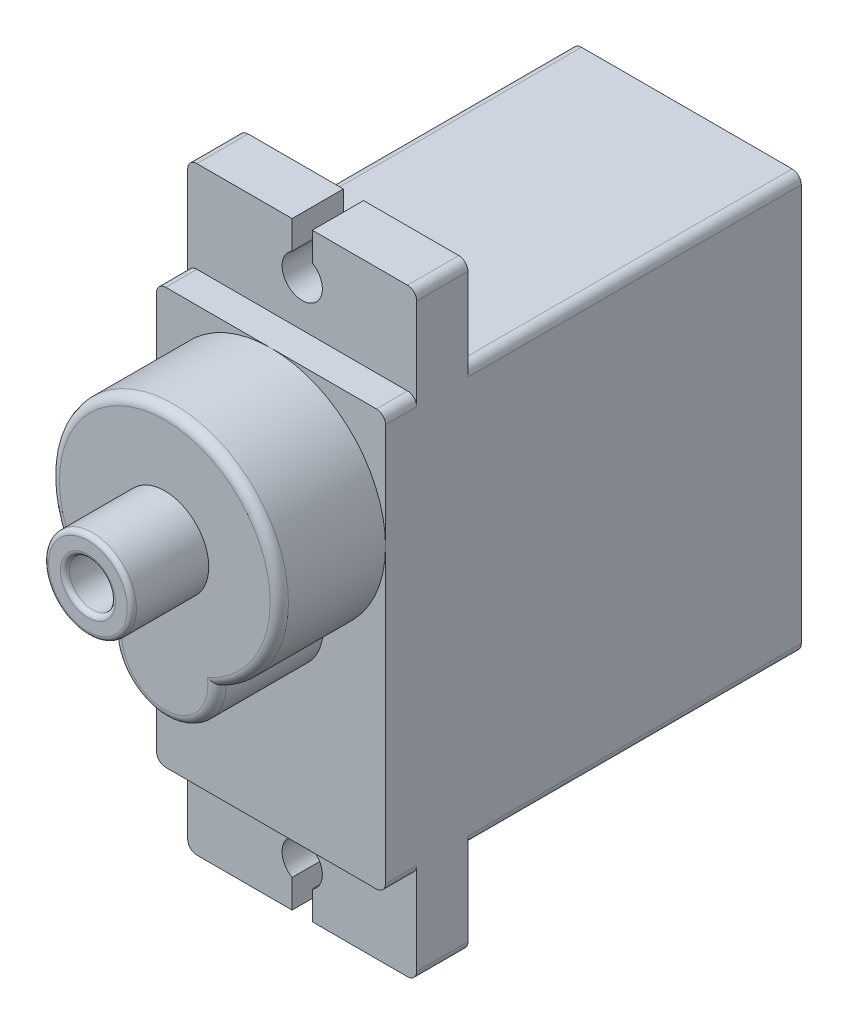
ISO-10303-21;
HEADER;
FILE_DESCRIPTION(('STEP AP214'),'2;1');
FILE_NAME('part.step','',(''),(''),'','','');
FILE_SCHEMA(('AUTOMOTIVE_DESIGN { 1 0 10303 214 1 1 1 1 }'));
ENDSEC;
DATA;
#1=APPLICATION_CONTEXT('core data for automotive mechanical design processes');
#2=APPLICATION_PROTOCOL_DEFINITION('international standard','automotive_design',2000,#1);
#3=PRODUCT_CONTEXT('',#1,'mechanical');
#4=PRODUCT('Part','Part','',(#3));
#5=PRODUCT_RELATED_PRODUCT_CATEGORY('part','',(#4));
#6=PRODUCT_DEFINITION_FORMATION('','',#4);
#7=PRODUCT_DEFINITION_CONTEXT('part definition',#1,'design');
#8=PRODUCT_DEFINITION('design','',#6,#7);
#9=PRODUCT_DEFINITION_SHAPE('','',#8);
#10=(LENGTH_UNIT() NAMED_UNIT(*) SI_UNIT(.MILLI.,.METRE.));
#11=(NAMED_UNIT(*) PLANE_ANGLE_UNIT() SI_UNIT($,.RADIAN.));
#12=(NAMED_UNIT(*) SI_UNIT($,.STERADIAN.) SOLID_ANGLE_UNIT());
#13=UNCERTAINTY_MEASURE_WITH_UNIT(LENGTH_MEASURE(1.E-05),#10,'distance_accuracy_value','');
#14=(GEOMETRIC_REPRESENTATION_CONTEXT(3) GLOBAL_UNCERTAINTY_ASSIGNED_CONTEXT((#13)) GLOBAL_UNIT_ASSIGNED_CONTEXT((#10,
#11,#12)) REPRESENTATION_CONTEXT('',''));
#15=CARTESIAN_POINT('',(0.,0.,0.));
#16=DIRECTION('',(0.,0.,1.));
#17=DIRECTION('',(1.,0.,0.));
#18=AXIS2_PLACEMENT_3D('',#15,#16,#17);
#19=CARTESIAN_POINT('',(-6.25,-16.35,18.2));
#20=DIRECTION('',(0.,-1.,0.));
#21=DIRECTION('',(0.,0.,-1.));
#22=AXIS2_PLACEMENT_3D('',#19,#20,#21);
#23=PLANE('',#22);
#24=DIRECTION('',(0.,0.,1.));
#25=VECTOR('',#24,1.);
#26=CARTESIAN_POINT('',(0.55,-16.35,18.2));
#27=LINE('',#26,#25);
#28=CARTESIAN_POINT('',(0.55,-16.35,18.2));
#29=VERTEX_POINT('',#28);
#30=CARTESIAN_POINT('',(0.55,-16.35,21.));
#31=VERTEX_POINT('',#30);
#32=EDGE_CURVE('E269',#29,#31,#27,.T.);
#33=ORIENTED_EDGE('',*,*,#32,.F.);
#34=DIRECTION('',(1.,0.,0.));
#35=VECTOR('',#34,1.);
#36=CARTESIAN_POINT('',(-6.25,-16.35,18.2));
#37=LINE('',#36,#35);
#38=CARTESIAN_POINT('',(5.75,-16.35,18.2));
#39=VERTEX_POINT('',#38);
#40=EDGE_CURVE('E568',#29,#39,#37,.T.);
#41=ORIENTED_EDGE('',*,*,#40,.T.);
#42=DIRECTION('',(0.,0.,1.));
#43=VECTOR('',#42,1.);
#44=CARTESIAN_POINT('',(5.75,-16.35,21.));
#45=LINE('',#44,#43);
#46=CARTESIAN_POINT('',(5.75,-16.35,21.));
#47=VERTEX_POINT('',#46);
#48=EDGE_CURVE('E290',#39,#47,#45,.T.);
#49=ORIENTED_EDGE('',*,*,#48,.T.);
#50=DIRECTION('',(1.,0.,0.));
#51=VECTOR('',#50,1.);
#52=CARTESIAN_POINT('',(-6.25,-16.35,21.));
#53=LINE('',#52,#51);
#54=EDGE_CURVE('E281',#31,#47,#53,.T.);
#55=ORIENTED_EDGE('',*,*,#54,.F.);
#56=EDGE_LOOP('',(#33,#41,#49,#55));
#57=FACE_BOUND('',#56,.T.);
#58=ADVANCED_FACE('F36',(#57),#23,.T.);
#59=CARTESIAN_POINT('',(-6.25,16.35,18.2));
#60=DIRECTION('',(0.,1.,0.));
#61=DIRECTION('',(0.,0.,1.));
#62=AXIS2_PLACEMENT_3D('',#59,#60,#61);
#63=PLANE('',#62);
#64=DIRECTION('',(0.,0.,-1.));
#65=VECTOR('',#64,1.);
#66=CARTESIAN_POINT('',(0.55,16.35,18.2));
#67=LINE('',#66,#65);
#68=CARTESIAN_POINT('',(0.55,16.35,21.));
#69=VERTEX_POINT('',#68);
#70=CARTESIAN_POINT('',(0.55,16.35,18.2));
#71=VERTEX_POINT('',#70);
#72=EDGE_CURVE('E608',#69,#71,#67,.T.);
#73=ORIENTED_EDGE('',*,*,#72,.F.);
#74=DIRECTION('',(-1.,0.,0.));
#75=VECTOR('',#74,1.);
#76=CARTESIAN_POINT('',(-6.25,16.35,21.));
#77=LINE('',#76,#75);
#78=CARTESIAN_POINT('',(5.75,16.35,21.));
#79=VERTEX_POINT('',#78);
#80=EDGE_CURVE('E306',#79,#69,#77,.T.);
#81=ORIENTED_EDGE('',*,*,#80,.F.);
#82=DIRECTION('',(0.,0.,1.));
#83=VECTOR('',#82,1.);
#84=CARTESIAN_POINT('',(5.75,16.35,18.2));
#85=LINE('',#84,#83);
#86=CARTESIAN_POINT('',(5.75,16.35,18.2));
#87=VERTEX_POINT('',#86);
#88=EDGE_CURVE('E434',#79,#87,#85,.F.);
#89=ORIENTED_EDGE('',*,*,#88,.T.);
#90=DIRECTION('',(-1.,0.,0.));
#91=VECTOR('',#90,1.);
#92=CARTESIAN_POINT('',(-6.25,16.35,18.2));
#93=LINE('',#92,#91);
#94=EDGE_CURVE('E313',#87,#71,#93,.T.);
#95=ORIENTED_EDGE('',*,*,#94,.T.);
#96=EDGE_LOOP('',(#73,#81,#89,#95));
#97=FACE_BOUND('',#96,.T.);
#98=ADVANCED_FACE('F525',(#97),#63,.T.);
#99=CARTESIAN_POINT('',(0.,0.,22.7));
#100=DIRECTION('',(0.,0.,1.));
#101=DIRECTION('',(1.,0.,0.));
#102=AXIS2_PLACEMENT_3D('',#99,#100,#101);
#103=PLANE('',#102);
#104=CARTESIAN_POINT('',(0.,5.09999999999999,22.7));
#105=DIRECTION('',(0.,0.,1.));
#106=DIRECTION('',(1.,0.,0.));
#107=AXIS2_PLACEMENT_3D('',#104,#105,#106);
#108=CIRCLE('',#107,6.25);
#109=CARTESIAN_POINT('',(6.25,5.09999999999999,22.7));
#110=VERTEX_POINT('',#109);
#111=CARTESIAN_POINT('',(0.,11.35,22.7));
#112=VERTEX_POINT('',#111);
#113=EDGE_CURVE('E589',#110,#112,#108,.T.);
#114=ORIENTED_EDGE('',*,*,#113,.F.);
#115=DIRECTION('',(0.,1.,0.));
#116=VECTOR('',#115,1.);
#117=CARTESIAN_POINT('',(6.25,11.35,22.7));
#118=LINE('',#117,#116);
#119=CARTESIAN_POINT('',(6.25,10.85,22.7));
#120=VERTEX_POINT('',#119);
#121=EDGE_CURVE('E333',#110,#120,#118,.T.);
#122=ORIENTED_EDGE('',*,*,#121,.T.);
#123=CARTESIAN_POINT('',(5.75,10.85,22.7));
#124=DIRECTION('',(0.,0.,1.));
#125=DIRECTION('',(1.,0.,0.));
#126=AXIS2_PLACEMENT_3D('',#123,#124,#125);
#127=CIRCLE('',#126,0.5);
#128=CARTESIAN_POINT('',(5.75,11.35,22.7));
#129=VERTEX_POINT('',#128);
#130=EDGE_CURVE('E402',#120,#129,#127,.T.);
#131=ORIENTED_EDGE('',*,*,#130,.T.);
#132=DIRECTION('',(-1.,0.,0.));
#133=VECTOR('',#132,1.);
#134=CARTESIAN_POINT('',(-6.25,11.35,22.7));
#135=LINE('',#134,#133);
#136=EDGE_CURVE('E334',#129,#112,#135,.T.);
#137=ORIENTED_EDGE('',*,*,#136,.T.);
#138=EDGE_LOOP('',(#114,#122,#131,#137));
#139=FACE_BOUND('',#138,.T.);
#140=ADVANCED_FACE('F531',(#139),#103,.T.);
#141=CARTESIAN_POINT('',(-6.25,5.09999999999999,22.7));
#142=VERTEX_POINT('',#141);
#143=EDGE_CURVE('E476',#112,#142,#108,.T.);
#144=ORIENTED_EDGE('',*,*,#143,.F.);
#145=CARTESIAN_POINT('',(-5.75,11.35,22.7));
#146=VERTEX_POINT('',#145);
#147=EDGE_CURVE('E332',#112,#146,#135,.T.);
#148=ORIENTED_EDGE('',*,*,#147,.T.);
#149=CARTESIAN_POINT('',(-5.75,10.85,22.7));
#150=DIRECTION('',(0.,0.,1.));
#151=DIRECTION('',(1.,0.,0.));
#152=AXIS2_PLACEMENT_3D('',#149,#150,#151);
#153=CIRCLE('',#152,0.5);
#154=CARTESIAN_POINT('',(-6.25,10.85,22.7));
#155=VERTEX_POINT('',#154);
#156=EDGE_CURVE('E404',#146,#155,#153,.T.);
#157=ORIENTED_EDGE('',*,*,#156,.T.);
#158=DIRECTION('',(0.,-1.,0.));
#159=VECTOR('',#158,1.);
#160=CARTESIAN_POINT('',(-6.25,11.35,22.7));
#161=LINE('',#160,#159);
#162=EDGE_CURVE('E338',#155,#142,#161,.T.);
#163=ORIENTED_EDGE('',*,*,#162,.T.);
#164=EDGE_LOOP('',(#144,#148,#157,#163));
#165=FACE_BOUND('',#164,.T.);
#166=ADVANCED_FACE('F914',(#165),#103,.T.);
#167=CARTESIAN_POINT('',(-6.25,-11.35,22.7));
#168=DIRECTION('',(0.,1.,0.));
#169=DIRECTION('',(0.,0.,1.));
#170=AXIS2_PLACEMENT_3D('',#167,#168,#169);
#171=PLANE('',#170);
#172=DIRECTION('',(1.,0.,0.));
#173=VECTOR('',#172,1.);
#174=CARTESIAN_POINT('',(-6.25,-11.35,22.7));
#175=LINE('',#174,#173);
#176=CARTESIAN_POINT('',(-5.75,-11.35,22.7));
#177=VERTEX_POINT('',#176);
#178=CARTESIAN_POINT('',(5.75,-11.35,22.7));
#179=VERTEX_POINT('',#178);
#180=EDGE_CURVE('E341',#177,#179,#175,.T.);
#181=ORIENTED_EDGE('',*,*,#180,.F.);
#182=DIRECTION('',(0.,0.,-1.));
#183=VECTOR('',#182,1.);
#184=CARTESIAN_POINT('',(-5.75,-11.35,22.7));
#185=LINE('',#184,#183);
#186=CARTESIAN_POINT('',(-5.75,-11.35,21.));
#187=VERTEX_POINT('',#186);
#188=EDGE_CURVE('E399',#177,#187,#185,.T.);
#189=ORIENTED_EDGE('',*,*,#188,.T.);
#190=DIRECTION('',(-1.,0.,0.));
#191=VECTOR('',#190,1.);
#192=CARTESIAN_POINT('',(-6.25,-11.35,21.));
#193=LINE('',#192,#191);
#194=CARTESIAN_POINT('',(5.75,-11.35,21.));
#195=VERTEX_POINT('',#194);
#196=EDGE_CURVE('E297',#195,#187,#193,.T.);
#197=ORIENTED_EDGE('',*,*,#196,.F.);
#198=DIRECTION('',(0.,0.,-1.));
#199=VECTOR('',#198,1.);
#200=CARTESIAN_POINT('',(5.75,-11.35,22.7));
#201=LINE('',#200,#199);
#202=EDGE_CURVE('E397',#195,#179,#201,.F.);
#203=ORIENTED_EDGE('',*,*,#202,.T.);
#204=EDGE_LOOP('',(#181,#189,#197,#203));
#205=FACE_BOUND('',#204,.T.);
#206=ADVANCED_FACE('F920',(#205),#171,.F.);
#207=CARTESIAN_POINT('',(-6.25,11.35,22.7));
#208=DIRECTION('',(0.,-1.,0.));
#209=DIRECTION('',(0.,0.,-1.));
#210=AXIS2_PLACEMENT_3D('',#207,#208,#209);
#211=PLANE('',#210);
#212=DIRECTION('',(1.,0.,0.));
#213=VECTOR('',#212,1.);
#214=CARTESIAN_POINT('',(-6.25,11.35,21.));
#215=LINE('',#214,#213);
#216=CARTESIAN_POINT('',(-5.75,11.35,21.));
#217=VERTEX_POINT('',#216);
#218=CARTESIAN_POINT('',(5.75,11.35,21.));
#219=VERTEX_POINT('',#218);
#220=EDGE_CURVE('E319',#217,#219,#215,.T.);
#221=ORIENTED_EDGE('',*,*,#220,.F.);
#222=DIRECTION('',(0.,0.,-1.));
#223=VECTOR('',#222,1.);
#224=CARTESIAN_POINT('',(-5.75,11.35,22.7));
#225=LINE('',#224,#223);
#226=EDGE_CURVE('E449',#217,#146,#225,.F.);
#227=ORIENTED_EDGE('',*,*,#226,.T.);
#228=ORIENTED_EDGE('',*,*,#147,.F.);
#229=ORIENTED_EDGE('',*,*,#136,.F.);
#230=DIRECTION('',(0.,0.,-1.));
#231=VECTOR('',#230,1.);
#232=CARTESIAN_POINT('',(5.75,11.35,22.7));
#233=LINE('',#232,#231);
#234=EDGE_CURVE('E446',#129,#219,#233,.T.);
#235=ORIENTED_EDGE('',*,*,#234,.T.);
#236=EDGE_LOOP('',(#221,#227,#228,#229,#235));
#237=FACE_BOUND('',#236,.T.);
#238=ADVANCED_FACE('F951',(#237),#211,.F.);
#239=CARTESIAN_POINT('',(6.25,11.35,22.7));
#240=DIRECTION('',(-1.,0.,0.));
#241=DIRECTION('',(0.,-1.,0.));
#242=AXIS2_PLACEMENT_3D('',#239,#240,#241);
#243=PLANE('',#242);
#244=CARTESIAN_POINT('',(6.25,-10.85,22.7));
#245=VERTEX_POINT('',#244);
#246=EDGE_CURVE('E329',#245,#110,#118,.T.);
#247=ORIENTED_EDGE('',*,*,#246,.F.);
#248=DIRECTION('',(0.,0.,-1.));
#249=VECTOR('',#248,1.);
#250=CARTESIAN_POINT('',(6.25,-10.85,22.7));
#251=LINE('',#250,#249);
#252=CARTESIAN_POINT('',(6.25,-10.85,21.));
#253=VERTEX_POINT('',#252);
#254=EDGE_CURVE('E424',#245,#253,#251,.T.);
#255=ORIENTED_EDGE('',*,*,#254,.T.);
#256=DIRECTION('',(0.,1.,0.));
#257=VECTOR('',#256,1.);
#258=CARTESIAN_POINT('',(6.25,-11.35,21.));
#259=LINE('',#258,#257);
#260=CARTESIAN_POINT('',(6.25,-15.85,21.));
#261=VERTEX_POINT('',#260);
#262=EDGE_CURVE('E295',#261,#253,#259,.T.);
#263=ORIENTED_EDGE('',*,*,#262,.F.);
#264=DIRECTION('',(0.,0.,1.));
#265=VECTOR('',#264,1.);
#266=CARTESIAN_POINT('',(6.25,-15.85,18.2));
#267=LINE('',#266,#265);
#268=CARTESIAN_POINT('',(6.25,-15.85,18.2));
#269=VERTEX_POINT('',#268);
#270=EDGE_CURVE('E422',#261,#269,#267,.F.);
#271=ORIENTED_EDGE('',*,*,#270,.T.);
#272=DIRECTION('',(0.,1.,0.));
#273=VECTOR('',#272,1.);
#274=CARTESIAN_POINT('',(6.25,-11.35,18.2));
#275=LINE('',#274,#273);
#276=CARTESIAN_POINT('',(6.25,-10.85,18.2));
#277=VERTEX_POINT('',#276);
#278=EDGE_CURVE('E320',#269,#277,#275,.T.);
#279=ORIENTED_EDGE('',*,*,#278,.T.);
#280=DIRECTION('',(0.,0.,-1.));
#281=VECTOR('',#280,1.);
#282=CARTESIAN_POINT('',(6.25,-10.85,22.7));
#283=LINE('',#282,#281);
#284=CARTESIAN_POINT('',(6.25,-10.85,0.));
#285=VERTEX_POINT('',#284);
#286=EDGE_CURVE('E419',#277,#285,#283,.T.);
#287=ORIENTED_EDGE('',*,*,#286,.T.);
#288=DIRECTION('',(0.,1.,0.));
#289=VECTOR('',#288,1.);
#290=CARTESIAN_POINT('',(6.25,11.35,0.));
#291=LINE('',#290,#289);
#292=CARTESIAN_POINT('',(6.25,10.85,0.));
#293=VERTEX_POINT('',#292);
#294=EDGE_CURVE('E316',#285,#293,#291,.T.);
#295=ORIENTED_EDGE('',*,*,#294,.T.);
#296=DIRECTION('',(0.,0.,-1.));
#297=VECTOR('',#296,1.);
#298=CARTESIAN_POINT('',(6.25,10.85,22.7));
#299=LINE('',#298,#297);
#300=CARTESIAN_POINT('',(6.25,10.85,18.2));
#301=VERTEX_POINT('',#300);
#302=EDGE_CURVE('E410',#293,#301,#299,.F.);
#303=ORIENTED_EDGE('',*,*,#302,.T.);
#304=DIRECTION('',(0.,1.,0.));
#305=VECTOR('',#304,1.);
#306=CARTESIAN_POINT('',(6.25,11.35,18.2));
#307=LINE('',#306,#305);
#308=CARTESIAN_POINT('',(6.25,15.85,18.2));
#309=VERTEX_POINT('',#308);
#310=EDGE_CURVE('E309',#301,#309,#307,.T.);
#311=ORIENTED_EDGE('',*,*,#310,.T.);
#312=DIRECTION('',(0.,0.,1.));
#313=VECTOR('',#312,1.);
#314=CARTESIAN_POINT('',(6.25,15.85,21.));
#315=LINE('',#314,#313);
#316=CARTESIAN_POINT('',(6.25,15.85,21.));
#317=VERTEX_POINT('',#316);
#318=EDGE_CURVE('E416',#309,#317,#315,.T.);
#319=ORIENTED_EDGE('',*,*,#318,.T.);
#320=DIRECTION('',(0.,1.,0.));
#321=VECTOR('',#320,1.);
#322=CARTESIAN_POINT('',(6.25,11.35,21.));
#323=LINE('',#322,#321);
#324=CARTESIAN_POINT('',(6.25,10.85,21.));
#325=VERTEX_POINT('',#324);
#326=EDGE_CURVE('E323',#325,#317,#323,.T.);
#327=ORIENTED_EDGE('',*,*,#326,.F.);
#328=DIRECTION('',(0.,0.,-1.));
#329=VECTOR('',#328,1.);
#330=CARTESIAN_POINT('',(6.25,10.85,22.7));
#331=LINE('',#330,#329);
#332=EDGE_CURVE('E413',#325,#120,#331,.F.);
#333=ORIENTED_EDGE('',*,*,#332,.T.);
#334=ORIENTED_EDGE('',*,*,#121,.F.);
#335=EDGE_LOOP('',(#247,#255,#263,#271,#279,#287,#295,#303,#311,#319,#327,#333,#334));
#336=FACE_BOUND('',#335,.T.);
#337=ADVANCED_FACE('F960',(#336),#243,.F.);
#338=DIRECTION('',(-1.,0.,0.));
#339=VECTOR('',#338,1.);
#340=CARTESIAN_POINT('',(-6.25,11.35,0.));
#341=LINE('',#340,#339);
#342=CARTESIAN_POINT('',(5.75,11.35,0.));
#343=VERTEX_POINT('',#342);
#344=CARTESIAN_POINT('',(-5.75,11.35,0.));
#345=VERTEX_POINT('',#344);
#346=EDGE_CURVE('E347',#343,#345,#341,.T.);
#347=ORIENTED_EDGE('',*,*,#346,.T.);
#348=DIRECTION('',(0.,0.,-1.));
#349=VECTOR('',#348,1.);
#350=CARTESIAN_POINT('',(-5.75,11.35,22.7));
#351=LINE('',#350,#349);
#352=CARTESIAN_POINT('',(-5.75,11.35,18.2));
#353=VERTEX_POINT('',#352);
#354=EDGE_CURVE('E444',#345,#353,#351,.F.);
#355=ORIENTED_EDGE('',*,*,#354,.T.);
#356=DIRECTION('',(1.,0.,0.));
#357=VECTOR('',#356,1.);
#358=CARTESIAN_POINT('',(-6.25,11.35,18.2));
#359=LINE('',#358,#357);
#360=CARTESIAN_POINT('',(5.75,11.35,18.2));
#361=VERTEX_POINT('',#360);
#362=EDGE_CURVE('E305',#353,#361,#359,.T.);
#363=ORIENTED_EDGE('',*,*,#362,.T.);
#364=DIRECTION('',(0.,0.,-1.));
#365=VECTOR('',#364,1.);
#366=CARTESIAN_POINT('',(5.75,11.35,22.7));
#367=LINE('',#366,#365);
#368=EDGE_CURVE('E441',#361,#343,#367,.T.);
#369=ORIENTED_EDGE('',*,*,#368,.T.);
#370=EDGE_LOOP('',(#347,#355,#363,#369));
#371=FACE_BOUND('',#370,.T.);
#372=ADVANCED_FACE('F963',(#371),#211,.F.);
#373=CARTESIAN_POINT('',(-6.25,11.35,22.7));
#374=DIRECTION('',(1.,0.,0.));
#375=DIRECTION('',(0.,1.,0.));
#376=AXIS2_PLACEMENT_3D('',#373,#374,#375);
#377=PLANE('',#376);
#378=DIRECTION('',(0.,-1.,0.));
#379=VECTOR('',#378,1.);
#380=CARTESIAN_POINT('',(-6.25,11.35,0.));
#381=LINE('',#380,#379);
#382=CARTESIAN_POINT('',(-6.25,10.85,0.));
#383=VERTEX_POINT('',#382);
#384=CARTESIAN_POINT('',(-6.25,-10.85,0.));
#385=VERTEX_POINT('',#384);
#386=EDGE_CURVE('E350',#383,#385,#381,.T.);
#387=ORIENTED_EDGE('',*,*,#386,.T.);
#388=DIRECTION('',(0.,0.,-1.));
#389=VECTOR('',#388,1.);
#390=CARTESIAN_POINT('',(-6.25,-10.85,22.7));
#391=LINE('',#390,#389);
#392=CARTESIAN_POINT('',(-6.25,-10.85,18.2));
#393=VERTEX_POINT('',#392);
#394=EDGE_CURVE('E382',#385,#393,#391,.F.);
#395=ORIENTED_EDGE('',*,*,#394,.T.);
#396=DIRECTION('',(0.,-1.,0.));
#397=VECTOR('',#396,1.);
#398=CARTESIAN_POINT('',(-6.25,-11.35,18.2));
#399=LINE('',#398,#397);
#400=CARTESIAN_POINT('',(-6.25,-15.85,18.2));
#401=VERTEX_POINT('',#400);
#402=EDGE_CURVE('E565',#393,#401,#399,.T.);
#403=ORIENTED_EDGE('',*,*,#402,.T.);
#404=DIRECTION('',(0.,0.,1.));
#405=VECTOR('',#404,1.);
#406=CARTESIAN_POINT('',(-6.25,-15.85,21.));
#407=LINE('',#406,#405);
#408=CARTESIAN_POINT('',(-6.25,-15.85,21.));
#409=VERTEX_POINT('',#408);
#410=EDGE_CURVE('E379',#401,#409,#407,.T.);
#411=ORIENTED_EDGE('',*,*,#410,.T.);
#412=DIRECTION('',(0.,-1.,0.));
#413=VECTOR('',#412,1.);
#414=CARTESIAN_POINT('',(-6.25,-11.35,21.));
#415=LINE('',#414,#413);
#416=CARTESIAN_POINT('',(-6.25,-10.85,21.));
#417=VERTEX_POINT('',#416);
#418=EDGE_CURVE('E292',#417,#409,#415,.T.);
#419=ORIENTED_EDGE('',*,*,#418,.F.);
#420=DIRECTION('',(0.,0.,-1.));
#421=VECTOR('',#420,1.);
#422=CARTESIAN_POINT('',(-6.25,-10.85,22.7));
#423=LINE('',#422,#421);
#424=CARTESIAN_POINT('',(-6.25,-10.85,22.7));
#425=VERTEX_POINT('',#424);
#426=EDGE_CURVE('E376',#417,#425,#423,.F.);
#427=ORIENTED_EDGE('',*,*,#426,.T.);
#428=EDGE_CURVE('E337',#142,#425,#161,.T.);
#429=ORIENTED_EDGE('',*,*,#428,.F.);
#430=ORIENTED_EDGE('',*,*,#162,.F.);
#431=DIRECTION('',(0.,0.,-1.));
#432=VECTOR('',#431,1.);
#433=CARTESIAN_POINT('',(-6.25,10.85,22.7));
#434=LINE('',#433,#432);
#435=CARTESIAN_POINT('',(-6.25,10.85,21.));
#436=VERTEX_POINT('',#435);
#437=EDGE_CURVE('E368',#155,#436,#434,.T.);
#438=ORIENTED_EDGE('',*,*,#437,.T.);
#439=DIRECTION('',(0.,-1.,0.));
#440=VECTOR('',#439,1.);
#441=CARTESIAN_POINT('',(-6.25,11.35,21.));
#442=LINE('',#441,#440);
#443=CARTESIAN_POINT('',(-6.25,15.85,21.));
#444=VERTEX_POINT('',#443);
#445=EDGE_CURVE('E317',#444,#436,#442,.T.);
#446=ORIENTED_EDGE('',*,*,#445,.F.);
#447=DIRECTION('',(0.,0.,1.));
#448=VECTOR('',#447,1.);
#449=CARTESIAN_POINT('',(-6.25,15.85,18.2));
#450=LINE('',#449,#448);
#451=CARTESIAN_POINT('',(-6.25,15.85,18.2));
#452=VERTEX_POINT('',#451);
#453=EDGE_CURVE('E374',#444,#452,#450,.F.);
#454=ORIENTED_EDGE('',*,*,#453,.T.);
#455=DIRECTION('',(0.,-1.,0.));
#456=VECTOR('',#455,1.);
#457=CARTESIAN_POINT('',(-6.25,11.35,18.2));
#458=LINE('',#457,#456);
#459=CARTESIAN_POINT('',(-6.25,10.85,18.2));
#460=VERTEX_POINT('',#459);
#461=EDGE_CURVE('E303',#452,#460,#458,.T.);
#462=ORIENTED_EDGE('',*,*,#461,.T.);
#463=DIRECTION('',(0.,0.,-1.));
#464=VECTOR('',#463,1.);
#465=CARTESIAN_POINT('',(-6.25,10.85,22.7));
#466=LINE('',#465,#464);
#467=EDGE_CURVE('E371',#460,#383,#466,.T.);
#468=ORIENTED_EDGE('',*,*,#467,.T.);
#469=EDGE_LOOP('',(#387,#395,#403,#411,#419,#427,#429,#430,#438,#446,#454,#462,#468));
#470=FACE_BOUND('',#469,.T.);
#471=ADVANCED_FACE('F564',(#470),#377,.F.);
#472=DIRECTION('',(-1.,0.,0.));
#473=VECTOR('',#472,1.);
#474=CARTESIAN_POINT('',(-6.25,-11.35,18.2));
#475=LINE('',#474,#473);
#476=CARTESIAN_POINT('',(5.75,-11.35,18.2));
#477=VERTEX_POINT('',#476);
#478=CARTESIAN_POINT('',(-5.75,-11.35,18.2));
#479=VERTEX_POINT('',#478);
#480=EDGE_CURVE('E302',#477,#479,#475,.T.);
#481=ORIENTED_EDGE('',*,*,#480,.T.);
#482=DIRECTION('',(0.,0.,-1.));
#483=VECTOR('',#482,1.);
#484=CARTESIAN_POINT('',(-5.75,-11.35,22.7));
#485=LINE('',#484,#483);
#486=CARTESIAN_POINT('',(-5.75,-11.35,0.));
#487=VERTEX_POINT('',#486);
#488=EDGE_CURVE('E357',#479,#487,#485,.T.);
#489=ORIENTED_EDGE('',*,*,#488,.T.);
#490=DIRECTION('',(1.,0.,0.));
#491=VECTOR('',#490,1.);
#492=CARTESIAN_POINT('',(-6.25,-11.35,0.));
#493=LINE('',#492,#491);
#494=CARTESIAN_POINT('',(5.75,-11.35,0.));
#495=VERTEX_POINT('',#494);
#496=EDGE_CURVE('E353',#487,#495,#493,.T.);
#497=ORIENTED_EDGE('',*,*,#496,.T.);
#498=DIRECTION('',(0.,0.,-1.));
#499=VECTOR('',#498,1.);
#500=CARTESIAN_POINT('',(5.75,-11.35,22.7));
#501=LINE('',#500,#499);
#502=EDGE_CURVE('E344',#495,#477,#501,.F.);
#503=ORIENTED_EDGE('',*,*,#502,.T.);
#504=EDGE_LOOP('',(#481,#489,#497,#503));
#505=FACE_BOUND('',#504,.T.);
#506=ADVANCED_FACE('F954',(#505),#171,.F.);
#507=CARTESIAN_POINT('',(0.,-0.500000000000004,22.7));
#508=DIRECTION('',(0.,0.,1.));
#509=DIRECTION('',(1.,0.,0.));
#510=AXIS2_PLACEMENT_3D('',#507,#508,#509);
#511=CIRCLE('',#510,2.85);
#512=CARTESIAN_POINT('',(-2.8497532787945,-0.46250000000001,22.7));
#513=VERTEX_POINT('',#512);
#514=CARTESIAN_POINT('',(2.8497532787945,-0.46250000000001,22.7));
#515=VERTEX_POINT('',#514);
#516=EDGE_CURVE('E600',#513,#515,#511,.T.);
#517=ORIENTED_EDGE('',*,*,#516,.F.);
#518=EDGE_CURVE('E595',#142,#513,#108,.T.);
#519=ORIENTED_EDGE('',*,*,#518,.F.);
#520=ORIENTED_EDGE('',*,*,#428,.T.);
#521=CARTESIAN_POINT('',(-5.75,-10.85,22.7));
#522=DIRECTION('',(0.,0.,1.));
#523=DIRECTION('',(1.,0.,0.));
#524=AXIS2_PLACEMENT_3D('',#521,#522,#523);
#525=CIRCLE('',#524,0.5);
#526=EDGE_CURVE('E408',#425,#177,#525,.T.);
#527=ORIENTED_EDGE('',*,*,#526,.T.);
#528=ORIENTED_EDGE('',*,*,#180,.T.);
#529=CARTESIAN_POINT('',(5.75,-10.85,22.7));
#530=DIRECTION('',(0.,0.,1.));
#531=DIRECTION('',(1.,0.,0.));
#532=AXIS2_PLACEMENT_3D('',#529,#530,#531);
#533=CIRCLE('',#532,0.5);
#534=EDGE_CURVE('E406',#179,#245,#533,.T.);
#535=ORIENTED_EDGE('',*,*,#534,.T.);
#536=ORIENTED_EDGE('',*,*,#246,.T.);
#537=EDGE_CURVE('E472',#515,#110,#108,.T.);
#538=ORIENTED_EDGE('',*,*,#537,.F.);
#539=EDGE_LOOP('',(#517,#519,#520,#527,#528,#535,#536,#538));
#540=FACE_BOUND('',#539,.T.);
#541=ADVANCED_FACE('F923',(#540),#103,.T.);
#542=CARTESIAN_POINT('',(0.,0.,0.));
#543=DIRECTION('',(0.,0.,1.));
#544=DIRECTION('',(1.,0.,0.));
#545=AXIS2_PLACEMENT_3D('',#542,#543,#544);
#546=PLANE('',#545);
#547=ORIENTED_EDGE('',*,*,#496,.F.);
#548=CARTESIAN_POINT('',(-5.75,-10.85,0.));
#549=DIRECTION('',(0.,0.,1.));
#550=DIRECTION('',(1.,0.,0.));
#551=AXIS2_PLACEMENT_3D('',#548,#549,#550);
#552=CIRCLE('',#551,0.5);
#553=EDGE_CURVE('E366',#487,#385,#552,.F.);
#554=ORIENTED_EDGE('',*,*,#553,.T.);
#555=ORIENTED_EDGE('',*,*,#386,.F.);
#556=CARTESIAN_POINT('',(-5.75,10.85,0.));
#557=DIRECTION('',(0.,0.,1.));
#558=DIRECTION('',(1.,0.,0.));
#559=AXIS2_PLACEMENT_3D('',#556,#557,#558);
#560=CIRCLE('',#559,0.5);
#561=EDGE_CURVE('E362',#383,#345,#560,.F.);
#562=ORIENTED_EDGE('',*,*,#561,.T.);
#563=ORIENTED_EDGE('',*,*,#346,.F.);
#564=CARTESIAN_POINT('',(5.75,10.85,0.));
#565=DIRECTION('',(0.,0.,1.));
#566=DIRECTION('',(1.,0.,0.));
#567=AXIS2_PLACEMENT_3D('',#564,#565,#566);
#568=CIRCLE('',#567,0.5);
#569=EDGE_CURVE('E360',#343,#293,#568,.F.);
#570=ORIENTED_EDGE('',*,*,#569,.T.);
#571=ORIENTED_EDGE('',*,*,#294,.F.);
#572=CARTESIAN_POINT('',(5.75,-10.85,0.));
#573=DIRECTION('',(0.,0.,1.));
#574=DIRECTION('',(1.,0.,0.));
#575=AXIS2_PLACEMENT_3D('',#572,#573,#574);
#576=CIRCLE('',#575,0.5);
#577=EDGE_CURVE('E364',#285,#495,#576,.F.);
#578=ORIENTED_EDGE('',*,*,#577,.T.);
#579=EDGE_LOOP('',(#547,#554,#555,#562,#563,#570,#571,#578));
#580=FACE_BOUND('',#579,.T.);
#581=ADVANCED_FACE('F856',(#580),#546,.F.);
#582=DIRECTION('',(0.,0.,1.));
#583=VECTOR('',#582,1.);
#584=CARTESIAN_POINT('',(-0.55,16.35,18.2));
#585=LINE('',#584,#583);
#586=CARTESIAN_POINT('',(-0.55,16.35,18.2));
#587=VERTEX_POINT('',#586);
#588=CARTESIAN_POINT('',(-0.55,16.35,21.));
#589=VERTEX_POINT('',#588);
#590=EDGE_CURVE('E612',#587,#589,#585,.T.);
#591=ORIENTED_EDGE('',*,*,#590,.F.);
#592=CARTESIAN_POINT('',(-5.75,16.35,18.2));
#593=VERTEX_POINT('',#592);
#594=EDGE_CURVE('E312',#587,#593,#93,.T.);
#595=ORIENTED_EDGE('',*,*,#594,.T.);
#596=DIRECTION('',(0.,0.,1.));
#597=VECTOR('',#596,1.);
#598=CARTESIAN_POINT('',(-5.75,16.35,21.));
#599=LINE('',#598,#597);
#600=CARTESIAN_POINT('',(-5.75,16.35,21.));
#601=VERTEX_POINT('',#600);
#602=EDGE_CURVE('E431',#593,#601,#599,.T.);
#603=ORIENTED_EDGE('',*,*,#602,.T.);
#604=EDGE_CURVE('E326',#589,#601,#77,.T.);
#605=ORIENTED_EDGE('',*,*,#604,.F.);
#606=EDGE_LOOP('',(#591,#595,#603,#605));
#607=FACE_BOUND('',#606,.T.);
#608=ADVANCED_FACE('F534',(#607),#63,.T.);
#609=CARTESIAN_POINT('',(0.,0.,18.2));
#610=DIRECTION('',(0.,0.,-1.));
#611=DIRECTION('',(-1.,0.,0.));
#612=AXIS2_PLACEMENT_3D('',#609,#610,#611);
#613=PLANE('',#612);
#614=DIRECTION('',(0.,-1.,0.));
#615=VECTOR('',#614,1.);
#616=CARTESIAN_POINT('',(0.55,0.,18.2));
#617=LINE('',#616,#615);
#618=CARTESIAN_POINT('',(0.55,14.8026279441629,18.2));
#619=VERTEX_POINT('',#618);
#620=EDGE_CURVE('E610',#71,#619,#617,.T.);
#621=ORIENTED_EDGE('',*,*,#620,.F.);
#622=ORIENTED_EDGE('',*,*,#94,.F.);
#623=CARTESIAN_POINT('',(5.75,15.85,18.2));
#624=DIRECTION('',(0.,0.,-1.));
#625=DIRECTION('',(-1.,0.,0.));
#626=AXIS2_PLACEMENT_3D('',#623,#624,#625);
#627=CIRCLE('',#626,0.5);
#628=EDGE_CURVE('E439',#87,#309,#627,.T.);
#629=ORIENTED_EDGE('',*,*,#628,.T.);
#630=ORIENTED_EDGE('',*,*,#310,.F.);
#631=CARTESIAN_POINT('',(5.75,10.85,18.2));
#632=DIRECTION('',(0.,0.,-1.));
#633=DIRECTION('',(-1.,0.,0.));
#634=AXIS2_PLACEMENT_3D('',#631,#632,#633);
#635=CIRCLE('',#634,0.5);
#636=EDGE_CURVE('E470',#301,#361,#635,.F.);
#637=ORIENTED_EDGE('',*,*,#636,.T.);
#638=ORIENTED_EDGE('',*,*,#362,.F.);
#639=CARTESIAN_POINT('',(-5.75,10.85,18.2));
#640=DIRECTION('',(0.,0.,-1.));
#641=DIRECTION('',(-1.,0.,0.));
#642=AXIS2_PLACEMENT_3D('',#639,#640,#641);
#643=CIRCLE('',#642,0.5);
#644=EDGE_CURVE('E462',#353,#460,#643,.F.);
#645=ORIENTED_EDGE('',*,*,#644,.T.);
#646=ORIENTED_EDGE('',*,*,#461,.F.);
#647=CARTESIAN_POINT('',(-5.75,15.85,18.2));
#648=DIRECTION('',(0.,0.,-1.));
#649=DIRECTION('',(-1.,0.,0.));
#650=AXIS2_PLACEMENT_3D('',#647,#648,#649);
#651=CIRCLE('',#650,0.5);
#652=EDGE_CURVE('E436',#452,#593,#651,.T.);
#653=ORIENTED_EDGE('',*,*,#652,.T.);
#654=ORIENTED_EDGE('',*,*,#594,.F.);
#655=DIRECTION('',(0.,1.,0.));
#656=VECTOR('',#655,1.);
#657=CARTESIAN_POINT('',(-0.55,0.,18.2));
#658=LINE('',#657,#656);
#659=CARTESIAN_POINT('',(-0.55,14.8026279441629,18.2));
#660=VERTEX_POINT('',#659);
#661=EDGE_CURVE('E614',#660,#587,#658,.T.);
#662=ORIENTED_EDGE('',*,*,#661,.F.);
#663=CARTESIAN_POINT('',(0.,13.85,18.2));
#664=DIRECTION('',(0.,0.,1.));
#665=DIRECTION('',(1.,0.,0.));
#666=AXIS2_PLACEMENT_3D('',#663,#664,#665);
#667=CIRCLE('',#666,1.1);
#668=EDGE_CURVE('E576',#660,#619,#667,.T.);
#669=ORIENTED_EDGE('',*,*,#668,.T.);
#670=EDGE_LOOP('',(#621,#622,#629,#630,#637,#638,#645,#646,#653,#654,#662,#669));
#671=FACE_BOUND('',#670,.T.);
#672=ADVANCED_FACE('F547',(#671),#613,.T.);
#673=CARTESIAN_POINT('',(0.,0.,21.));
#674=DIRECTION('',(0.,0.,-1.));
#675=DIRECTION('',(-1.,0.,0.));
#676=AXIS2_PLACEMENT_3D('',#673,#674,#675);
#677=PLANE('',#676);
#678=ORIENTED_EDGE('',*,*,#80,.T.);
#679=DIRECTION('',(0.,1.,0.));
#680=VECTOR('',#679,1.);
#681=CARTESIAN_POINT('',(0.55,13.8231162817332,21.));
#682=LINE('',#681,#680);
#683=CARTESIAN_POINT('',(0.55,14.8026279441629,21.));
#684=VERTEX_POINT('',#683);
#685=EDGE_CURVE('E276',#684,#69,#682,.T.);
#686=ORIENTED_EDGE('',*,*,#685,.F.);
#687=CARTESIAN_POINT('',(0.,13.85,21.));
#688=DIRECTION('',(0.,0.,1.));
#689=DIRECTION('',(1.,0.,0.));
#690=AXIS2_PLACEMENT_3D('',#687,#688,#689);
#691=CIRCLE('',#690,1.1);
#692=CARTESIAN_POINT('',(-0.55,14.8026279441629,21.));
#693=VERTEX_POINT('',#692);
#694=EDGE_CURVE('E579',#693,#684,#691,.T.);
#695=ORIENTED_EDGE('',*,*,#694,.F.);
#696=DIRECTION('',(0.,-1.,0.));
#697=VECTOR('',#696,1.);
#698=CARTESIAN_POINT('',(-0.55,13.8231162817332,21.));
#699=LINE('',#698,#697);
#700=EDGE_CURVE('E616',#589,#693,#699,.T.);
#701=ORIENTED_EDGE('',*,*,#700,.F.);
#702=ORIENTED_EDGE('',*,*,#604,.T.);
#703=CARTESIAN_POINT('',(-5.75,15.85,21.));
#704=DIRECTION('',(0.,0.,-1.));
#705=DIRECTION('',(-1.,0.,0.));
#706=AXIS2_PLACEMENT_3D('',#703,#704,#705);
#707=CIRCLE('',#706,0.5);
#708=EDGE_CURVE('E427',#601,#444,#707,.F.);
#709=ORIENTED_EDGE('',*,*,#708,.T.);
#710=ORIENTED_EDGE('',*,*,#445,.T.);
#711=CARTESIAN_POINT('',(-5.75,10.85,21.));
#712=DIRECTION('',(0.,0.,-1.));
#713=DIRECTION('',(-1.,0.,0.));
#714=AXIS2_PLACEMENT_3D('',#711,#712,#713);
#715=CIRCLE('',#714,0.5);
#716=EDGE_CURVE('E465',#436,#217,#715,.T.);
#717=ORIENTED_EDGE('',*,*,#716,.T.);
#718=ORIENTED_EDGE('',*,*,#220,.T.);
#719=CARTESIAN_POINT('',(5.75,10.85,21.));
#720=DIRECTION('',(0.,0.,-1.));
#721=DIRECTION('',(-1.,0.,0.));
#722=AXIS2_PLACEMENT_3D('',#719,#720,#721);
#723=CIRCLE('',#722,0.5);
#724=EDGE_CURVE('E467',#219,#325,#723,.T.);
#725=ORIENTED_EDGE('',*,*,#724,.T.);
#726=ORIENTED_EDGE('',*,*,#326,.T.);
#727=CARTESIAN_POINT('',(5.75,15.85,21.));
#728=DIRECTION('',(0.,0.,-1.));
#729=DIRECTION('',(-1.,0.,0.));
#730=AXIS2_PLACEMENT_3D('',#727,#728,#729);
#731=CIRCLE('',#730,0.5);
#732=EDGE_CURVE('E429',#317,#79,#731,.F.);
#733=ORIENTED_EDGE('',*,*,#732,.T.);
#734=EDGE_LOOP('',(#678,#686,#695,#701,#702,#709,#710,#717,#718,#725,#726,#733));
#735=FACE_BOUND('',#734,.T.);
#736=ADVANCED_FACE('F539',(#735),#677,.F.);
#737=DIRECTION('',(0.,0.,-1.));
#738=VECTOR('',#737,1.);
#739=CARTESIAN_POINT('',(-0.55,-16.35,18.2));
#740=LINE('',#739,#738);
#741=CARTESIAN_POINT('',(-0.55,-16.35,21.));
#742=VERTEX_POINT('',#741);
#743=CARTESIAN_POINT('',(-0.55,-16.35,18.2));
#744=VERTEX_POINT('',#743);
#745=EDGE_CURVE('E553',#742,#744,#740,.T.);
#746=ORIENTED_EDGE('',*,*,#745,.F.);
#747=CARTESIAN_POINT('',(-5.75,-16.35,21.));
#748=VERTEX_POINT('',#747);
#749=EDGE_CURVE('E291',#748,#742,#53,.T.);
#750=ORIENTED_EDGE('',*,*,#749,.F.);
#751=DIRECTION('',(0.,0.,1.));
#752=VECTOR('',#751,1.);
#753=CARTESIAN_POINT('',(-5.75,-16.35,18.2));
#754=LINE('',#753,#752);
#755=CARTESIAN_POINT('',(-5.75,-16.35,18.2));
#756=VERTEX_POINT('',#755);
#757=EDGE_CURVE('E390',#748,#756,#754,.F.);
#758=ORIENTED_EDGE('',*,*,#757,.T.);
#759=EDGE_CURVE('E556',#756,#744,#37,.T.);
#760=ORIENTED_EDGE('',*,*,#759,.T.);
#761=EDGE_LOOP('',(#746,#750,#758,#760));
#762=FACE_BOUND('',#761,.T.);
#763=ADVANCED_FACE('F527',(#762),#23,.T.);
#764=CARTESIAN_POINT('',(0.,0.,18.2));
#765=DIRECTION('',(0.,0.,-1.));
#766=DIRECTION('',(-1.,0.,0.));
#767=AXIS2_PLACEMENT_3D('',#764,#765,#766);
#768=PLANE('',#767);
#769=DIRECTION('',(0.,-1.,0.));
#770=VECTOR('',#769,1.);
#771=CARTESIAN_POINT('',(0.55,0.,18.2));
#772=LINE('',#771,#770);
#773=CARTESIAN_POINT('',(0.55,-14.8026279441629,18.2));
#774=VERTEX_POINT('',#773);
#775=EDGE_CURVE('E272',#774,#29,#772,.T.);
#776=ORIENTED_EDGE('',*,*,#775,.F.);
#777=CARTESIAN_POINT('',(0.,-13.85,18.2));
#778=DIRECTION('',(0.,0.,1.));
#779=DIRECTION('',(1.,0.,0.));
#780=AXIS2_PLACEMENT_3D('',#777,#778,#779);
#781=CIRCLE('',#780,1.1);
#782=CARTESIAN_POINT('',(-0.55,-14.8026279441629,18.2));
#783=VERTEX_POINT('',#782);
#784=EDGE_CURVE('E586',#774,#783,#781,.T.);
#785=ORIENTED_EDGE('',*,*,#784,.T.);
#786=DIRECTION('',(0.,1.,0.));
#787=VECTOR('',#786,1.);
#788=CARTESIAN_POINT('',(-0.55,0.,18.2));
#789=LINE('',#788,#787);
#790=EDGE_CURVE('E58',#744,#783,#789,.T.);
#791=ORIENTED_EDGE('',*,*,#790,.F.);
#792=ORIENTED_EDGE('',*,*,#759,.F.);
#793=CARTESIAN_POINT('',(-5.75,-15.85,18.2));
#794=DIRECTION('',(0.,0.,-1.));
#795=DIRECTION('',(-1.,0.,0.));
#796=AXIS2_PLACEMENT_3D('',#793,#794,#795);
#797=CIRCLE('',#796,0.5);
#798=EDGE_CURVE('E395',#756,#401,#797,.T.);
#799=ORIENTED_EDGE('',*,*,#798,.T.);
#800=ORIENTED_EDGE('',*,*,#402,.F.);
#801=CARTESIAN_POINT('',(-5.75,-10.85,18.2));
#802=DIRECTION('',(0.,0.,-1.));
#803=DIRECTION('',(-1.,0.,0.));
#804=AXIS2_PLACEMENT_3D('',#801,#802,#803);
#805=CIRCLE('',#804,0.5);
#806=EDGE_CURVE('E452',#393,#479,#805,.F.);
#807=ORIENTED_EDGE('',*,*,#806,.T.);
#808=ORIENTED_EDGE('',*,*,#480,.F.);
#809=CARTESIAN_POINT('',(5.75,-10.85,18.2));
#810=DIRECTION('',(0.,0.,-1.));
#811=DIRECTION('',(-1.,0.,0.));
#812=AXIS2_PLACEMENT_3D('',#809,#810,#811);
#813=CIRCLE('',#812,0.5);
#814=EDGE_CURVE('E459',#477,#277,#813,.F.);
#815=ORIENTED_EDGE('',*,*,#814,.T.);
#816=ORIENTED_EDGE('',*,*,#278,.F.);
#817=CARTESIAN_POINT('',(5.75,-15.85,18.2));
#818=DIRECTION('',(0.,0.,-1.));
#819=DIRECTION('',(-1.,0.,0.));
#820=AXIS2_PLACEMENT_3D('',#817,#818,#819);
#821=CIRCLE('',#820,0.5);
#822=EDGE_CURVE('E392',#269,#39,#821,.T.);
#823=ORIENTED_EDGE('',*,*,#822,.T.);
#824=ORIENTED_EDGE('',*,*,#40,.F.);
#825=EDGE_LOOP('',(#776,#785,#791,#792,#799,#800,#807,#808,#815,#816,#823,#824));
#826=FACE_BOUND('',#825,.T.);
#827=ADVANCED_FACE('F538',(#826),#768,.T.);
#828=CARTESIAN_POINT('',(0.,0.,21.));
#829=DIRECTION('',(0.,0.,-1.));
#830=DIRECTION('',(-1.,0.,0.));
#831=AXIS2_PLACEMENT_3D('',#828,#829,#830);
#832=PLANE('',#831);
#833=CARTESIAN_POINT('',(0.,-13.85,21.));
#834=DIRECTION('',(0.,0.,1.));
#835=DIRECTION('',(1.,0.,0.));
#836=AXIS2_PLACEMENT_3D('',#833,#834,#835);
#837=CIRCLE('',#836,1.1);
#838=CARTESIAN_POINT('',(0.55,-14.8026279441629,21.));
#839=VERTEX_POINT('',#838);
#840=CARTESIAN_POINT('',(-0.55,-14.8026279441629,21.));
#841=VERTEX_POINT('',#840);
#842=EDGE_CURVE('E285',#839,#841,#837,.T.);
#843=ORIENTED_EDGE('',*,*,#842,.F.);
#844=DIRECTION('',(0.,1.,0.));
#845=VECTOR('',#844,1.);
#846=CARTESIAN_POINT('',(0.55,-13.7330151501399,21.));
#847=LINE('',#846,#845);
#848=EDGE_CURVE('E51',#31,#839,#847,.T.);
#849=ORIENTED_EDGE('',*,*,#848,.F.);
#850=ORIENTED_EDGE('',*,*,#54,.T.);
#851=CARTESIAN_POINT('',(5.75,-15.85,21.));
#852=DIRECTION('',(0.,0.,-1.));
#853=DIRECTION('',(-1.,0.,0.));
#854=AXIS2_PLACEMENT_3D('',#851,#852,#853);
#855=CIRCLE('',#854,0.5);
#856=EDGE_CURVE('E385',#47,#261,#855,.F.);
#857=ORIENTED_EDGE('',*,*,#856,.T.);
#858=ORIENTED_EDGE('',*,*,#262,.T.);
#859=CARTESIAN_POINT('',(5.75,-10.85,21.));
#860=DIRECTION('',(0.,0.,-1.));
#861=DIRECTION('',(-1.,0.,0.));
#862=AXIS2_PLACEMENT_3D('',#859,#860,#861);
#863=CIRCLE('',#862,0.5);
#864=EDGE_CURVE('E457',#253,#195,#863,.T.);
#865=ORIENTED_EDGE('',*,*,#864,.T.);
#866=ORIENTED_EDGE('',*,*,#196,.T.);
#867=CARTESIAN_POINT('',(-5.75,-10.85,21.));
#868=DIRECTION('',(0.,0.,-1.));
#869=DIRECTION('',(-1.,0.,0.));
#870=AXIS2_PLACEMENT_3D('',#867,#868,#869);
#871=CIRCLE('',#870,0.5);
#872=EDGE_CURVE('E454',#187,#417,#871,.T.);
#873=ORIENTED_EDGE('',*,*,#872,.T.);
#874=ORIENTED_EDGE('',*,*,#418,.T.);
#875=CARTESIAN_POINT('',(-5.75,-15.85,21.));
#876=DIRECTION('',(0.,0.,-1.));
#877=DIRECTION('',(-1.,0.,0.));
#878=AXIS2_PLACEMENT_3D('',#875,#876,#877);
#879=CIRCLE('',#878,0.5);
#880=EDGE_CURVE('E387',#409,#748,#879,.F.);
#881=ORIENTED_EDGE('',*,*,#880,.T.);
#882=ORIENTED_EDGE('',*,*,#749,.T.);
#883=DIRECTION('',(0.,-1.,0.));
#884=VECTOR('',#883,1.);
#885=CARTESIAN_POINT('',(-0.55,-13.7330151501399,21.));
#886=LINE('',#885,#884);
#887=EDGE_CURVE('E286',#841,#742,#886,.T.);
#888=ORIENTED_EDGE('',*,*,#887,.F.);
#889=EDGE_LOOP('',(#843,#849,#850,#857,#858,#865,#866,#873,#874,#881,#882,#888));
#890=FACE_BOUND('',#889,.T.);
#891=ADVANCED_FACE('F280',(#890),#832,.F.);
#892=CARTESIAN_POINT('',(0.,13.85,18.2));
#893=DIRECTION('',(0.,0.,1.));
#894=DIRECTION('',(1.,0.,0.));
#895=AXIS2_PLACEMENT_3D('',#892,#893,#894);
#896=CYLINDRICAL_SURFACE('',#895,1.1);
#897=ORIENTED_EDGE('',*,*,#694,.T.);
#898=DIRECTION('',(0.,0.,1.));
#899=VECTOR('',#898,1.);
#900=CARTESIAN_POINT('',(0.55,14.8026279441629,18.2));
#901=LINE('',#900,#899);
#902=EDGE_CURVE('E624',#684,#619,#901,.F.);
#903=ORIENTED_EDGE('',*,*,#902,.T.);
#904=ORIENTED_EDGE('',*,*,#668,.F.);
#905=DIRECTION('',(0.,0.,1.));
#906=VECTOR('',#905,1.);
#907=CARTESIAN_POINT('',(-0.55,14.8026279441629,18.2));
#908=LINE('',#907,#906);
#909=EDGE_CURVE('E626',#660,#693,#908,.T.);
#910=ORIENTED_EDGE('',*,*,#909,.T.);
#911=EDGE_LOOP('',(#897,#903,#904,#910));
#912=FACE_BOUND('',#911,.T.);
#913=ADVANCED_FACE('F677',(#912),#896,.F.);
#914=CARTESIAN_POINT('',(0.,-13.85,18.2));
#915=DIRECTION('',(0.,0.,1.));
#916=DIRECTION('',(1.,0.,0.));
#917=AXIS2_PLACEMENT_3D('',#914,#915,#916);
#918=CYLINDRICAL_SURFACE('',#917,1.1);
#919=ORIENTED_EDGE('',*,*,#784,.F.);
#920=DIRECTION('',(0.,0.,1.));
#921=VECTOR('',#920,1.);
#922=CARTESIAN_POINT('',(0.55,-14.8026279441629,18.2));
#923=LINE('',#922,#921);
#924=EDGE_CURVE('E11',#774,#839,#923,.T.);
#925=ORIENTED_EDGE('',*,*,#924,.T.);
#926=ORIENTED_EDGE('',*,*,#842,.T.);
#927=DIRECTION('',(0.,0.,1.));
#928=VECTOR('',#927,1.);
#929=CARTESIAN_POINT('',(-0.55,-14.8026279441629,18.2));
#930=LINE('',#929,#928);
#931=EDGE_CURVE('E44',#841,#783,#930,.F.);
#932=ORIENTED_EDGE('',*,*,#931,.T.);
#933=EDGE_LOOP('',(#919,#925,#926,#932));
#934=FACE_BOUND('',#933,.T.);
#935=ADVANCED_FACE('F673',(#934),#918,.F.);
#936=CARTESIAN_POINT('',(-5.75,-10.85,22.7));
#937=DIRECTION('',(0.,0.,-1.));
#938=DIRECTION('',(-1.,0.,0.));
#939=AXIS2_PLACEMENT_3D('',#936,#937,#938);
#940=CYLINDRICAL_SURFACE('',#939,0.5);
#941=ORIENTED_EDGE('',*,*,#806,.F.);
#942=ORIENTED_EDGE('',*,*,#394,.F.);
#943=ORIENTED_EDGE('',*,*,#553,.F.);
#944=ORIENTED_EDGE('',*,*,#488,.F.);
#945=EDGE_LOOP('',(#941,#942,#943,#944));
#946=FACE_BOUND('',#945,.T.);
#947=ADVANCED_FACE('F676',(#946),#940,.T.);
#948=CARTESIAN_POINT('',(-5.75,-15.85,22.7));
#949=DIRECTION('',(0.,0.,-1.));
#950=DIRECTION('',(-1.,0.,0.));
#951=AXIS2_PLACEMENT_3D('',#948,#949,#950);
#952=CYLINDRICAL_SURFACE('',#951,0.5);
#953=ORIENTED_EDGE('',*,*,#798,.F.);
#954=ORIENTED_EDGE('',*,*,#757,.F.);
#955=ORIENTED_EDGE('',*,*,#880,.F.);
#956=ORIENTED_EDGE('',*,*,#410,.F.);
#957=EDGE_LOOP('',(#953,#954,#955,#956));
#958=FACE_BOUND('',#957,.T.);
#959=ADVANCED_FACE('F561',(#958),#952,.T.);
#960=CARTESIAN_POINT('',(-5.75,-10.85,22.7));
#961=DIRECTION('',(0.,0.,-1.));
#962=DIRECTION('',(-1.,0.,0.));
#963=AXIS2_PLACEMENT_3D('',#960,#961,#962);
#964=CYLINDRICAL_SURFACE('',#963,0.5);
#965=ORIENTED_EDGE('',*,*,#526,.F.);
#966=ORIENTED_EDGE('',*,*,#426,.F.);
#967=ORIENTED_EDGE('',*,*,#872,.F.);
#968=ORIENTED_EDGE('',*,*,#188,.F.);
#969=EDGE_LOOP('',(#965,#966,#967,#968));
#970=FACE_BOUND('',#969,.T.);
#971=ADVANCED_FACE('F708',(#970),#964,.T.);
#972=CARTESIAN_POINT('',(5.75,-10.85,22.7));
#973=DIRECTION('',(0.,0.,-1.));
#974=DIRECTION('',(-1.,0.,0.));
#975=AXIS2_PLACEMENT_3D('',#972,#973,#974);
#976=CYLINDRICAL_SURFACE('',#975,0.5);
#977=ORIENTED_EDGE('',*,*,#534,.F.);
#978=ORIENTED_EDGE('',*,*,#202,.F.);
#979=ORIENTED_EDGE('',*,*,#864,.F.);
#980=ORIENTED_EDGE('',*,*,#254,.F.);
#981=EDGE_LOOP('',(#977,#978,#979,#980));
#982=FACE_BOUND('',#981,.T.);
#983=ADVANCED_FACE('F715',(#982),#976,.T.);
#984=CARTESIAN_POINT('',(5.75,-15.85,18.2));
#985=DIRECTION('',(0.,0.,-1.));
#986=DIRECTION('',(-1.,0.,0.));
#987=AXIS2_PLACEMENT_3D('',#984,#985,#986);
#988=CYLINDRICAL_SURFACE('',#987,0.5);
#989=ORIENTED_EDGE('',*,*,#822,.F.);
#990=ORIENTED_EDGE('',*,*,#270,.F.);
#991=ORIENTED_EDGE('',*,*,#856,.F.);
#992=ORIENTED_EDGE('',*,*,#48,.F.);
#993=EDGE_LOOP('',(#989,#990,#991,#992));
#994=FACE_BOUND('',#993,.T.);
#995=ADVANCED_FACE('F723',(#994),#988,.T.);
#996=CARTESIAN_POINT('',(5.75,-10.85,22.7));
#997=DIRECTION('',(0.,0.,-1.));
#998=DIRECTION('',(-1.,0.,0.));
#999=AXIS2_PLACEMENT_3D('',#996,#997,#998);
#1000=CYLINDRICAL_SURFACE('',#999,0.5);
#1001=ORIENTED_EDGE('',*,*,#814,.F.);
#1002=ORIENTED_EDGE('',*,*,#502,.F.);
#1003=ORIENTED_EDGE('',*,*,#577,.F.);
#1004=ORIENTED_EDGE('',*,*,#286,.F.);
#1005=EDGE_LOOP('',(#1001,#1002,#1003,#1004));
#1006=FACE_BOUND('',#1005,.T.);
#1007=ADVANCED_FACE('F731',(#1006),#1000,.T.);
#1008=CARTESIAN_POINT('',(5.75,15.85,22.7));
#1009=DIRECTION('',(0.,0.,-1.));
#1010=DIRECTION('',(-1.,0.,0.));
#1011=AXIS2_PLACEMENT_3D('',#1008,#1009,#1010);
#1012=CYLINDRICAL_SURFACE('',#1011,0.5);
#1013=ORIENTED_EDGE('',*,*,#628,.F.);
#1014=ORIENTED_EDGE('',*,*,#88,.F.);
#1015=ORIENTED_EDGE('',*,*,#732,.F.);
#1016=ORIENTED_EDGE('',*,*,#318,.F.);
#1017=EDGE_LOOP('',(#1013,#1014,#1015,#1016));
#1018=FACE_BOUND('',#1017,.T.);
#1019=ADVANCED_FACE('F739',(#1018),#1012,.T.);
#1020=CARTESIAN_POINT('',(-5.75,15.85,18.2));
#1021=DIRECTION('',(0.,0.,-1.));
#1022=DIRECTION('',(-1.,0.,0.));
#1023=AXIS2_PLACEMENT_3D('',#1020,#1021,#1022);
#1024=CYLINDRICAL_SURFACE('',#1023,0.5);
#1025=ORIENTED_EDGE('',*,*,#652,.F.);
#1026=ORIENTED_EDGE('',*,*,#453,.F.);
#1027=ORIENTED_EDGE('',*,*,#708,.F.);
#1028=ORIENTED_EDGE('',*,*,#602,.F.);
#1029=EDGE_LOOP('',(#1025,#1026,#1027,#1028));
#1030=FACE_BOUND('',#1029,.T.);
#1031=ADVANCED_FACE('F747',(#1030),#1024,.T.);
#1032=CARTESIAN_POINT('',(-5.75,10.85,22.7));
#1033=DIRECTION('',(0.,0.,-1.));
#1034=DIRECTION('',(-1.,0.,0.));
#1035=AXIS2_PLACEMENT_3D('',#1032,#1033,#1034);
#1036=CYLINDRICAL_SURFACE('',#1035,0.5);
#1037=ORIENTED_EDGE('',*,*,#644,.F.);
#1038=ORIENTED_EDGE('',*,*,#354,.F.);
#1039=ORIENTED_EDGE('',*,*,#561,.F.);
#1040=ORIENTED_EDGE('',*,*,#467,.F.);
#1041=EDGE_LOOP('',(#1037,#1038,#1039,#1040));
#1042=FACE_BOUND('',#1041,.T.);
#1043=ADVANCED_FACE('F755',(#1042),#1036,.T.);
#1044=CARTESIAN_POINT('',(-5.75,10.85,22.7));
#1045=DIRECTION('',(0.,0.,-1.));
#1046=DIRECTION('',(-1.,0.,0.));
#1047=AXIS2_PLACEMENT_3D('',#1044,#1045,#1046);
#1048=CYLINDRICAL_SURFACE('',#1047,0.5);
#1049=ORIENTED_EDGE('',*,*,#156,.F.);
#1050=ORIENTED_EDGE('',*,*,#226,.F.);
#1051=ORIENTED_EDGE('',*,*,#716,.F.);
#1052=ORIENTED_EDGE('',*,*,#437,.F.);
#1053=EDGE_LOOP('',(#1049,#1050,#1051,#1052));
#1054=FACE_BOUND('',#1053,.T.);
#1055=ADVANCED_FACE('F763',(#1054),#1048,.T.);
#1056=CARTESIAN_POINT('',(5.75,10.85,22.7));
#1057=DIRECTION('',(0.,0.,-1.));
#1058=DIRECTION('',(-1.,0.,0.));
#1059=AXIS2_PLACEMENT_3D('',#1056,#1057,#1058);
#1060=CYLINDRICAL_SURFACE('',#1059,0.5);
#1061=ORIENTED_EDGE('',*,*,#130,.F.);
#1062=ORIENTED_EDGE('',*,*,#332,.F.);
#1063=ORIENTED_EDGE('',*,*,#724,.F.);
#1064=ORIENTED_EDGE('',*,*,#234,.F.);
#1065=EDGE_LOOP('',(#1061,#1062,#1063,#1064));
#1066=FACE_BOUND('',#1065,.T.);
#1067=ADVANCED_FACE('F771',(#1066),#1060,.T.);
#1068=CARTESIAN_POINT('',(5.75,10.85,22.7));
#1069=DIRECTION('',(0.,0.,-1.));
#1070=DIRECTION('',(-1.,0.,0.));
#1071=AXIS2_PLACEMENT_3D('',#1068,#1069,#1070);
#1072=CYLINDRICAL_SURFACE('',#1071,0.5);
#1073=ORIENTED_EDGE('',*,*,#636,.F.);
#1074=ORIENTED_EDGE('',*,*,#302,.F.);
#1075=ORIENTED_EDGE('',*,*,#569,.F.);
#1076=ORIENTED_EDGE('',*,*,#368,.F.);
#1077=EDGE_LOOP('',(#1073,#1074,#1075,#1076));
#1078=FACE_BOUND('',#1077,.T.);
#1079=ADVANCED_FACE('F671',(#1078),#1072,.T.);
#1080=CARTESIAN_POINT('',(0.,5.09999999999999,28.5));
#1081=DIRECTION('',(0.,0.,-1.));
#1082=DIRECTION('',(-1.,0.,0.));
#1083=AXIS2_PLACEMENT_3D('',#1080,#1081,#1082);
#1084=CYLINDRICAL_SURFACE('',#1083,6.25);
#1085=DIRECTION('',(0.,0.,1.));
#1086=VECTOR('',#1085,1.);
#1087=CARTESIAN_POINT('',(-2.8497532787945,-0.462500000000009,25.6));
#1088=LINE('',#1087,#1086);
#1089=CARTESIAN_POINT('',(-2.8497532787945,-0.462500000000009,28.));
#1090=VERTEX_POINT('',#1089);
#1091=EDGE_CURVE('E594',#513,#1090,#1088,.T.);
#1092=ORIENTED_EDGE('',*,*,#1091,.T.);
#1093=CARTESIAN_POINT('',(0.,5.09999999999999,28.));
#1094=DIRECTION('',(0.,0.,1.));
#1095=DIRECTION('',(1.,0.,0.));
#1096=AXIS2_PLACEMENT_3D('',#1093,#1094,#1095);
#1097=CIRCLE('',#1096,6.25);
#1098=CARTESIAN_POINT('',(2.8497532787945,-0.462500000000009,28.));
#1099=VERTEX_POINT('',#1098);
#1100=EDGE_CURVE('E482',#1090,#1099,#1097,.F.);
#1101=ORIENTED_EDGE('',*,*,#1100,.T.);
#1102=DIRECTION('',(0.,0.,1.));
#1103=VECTOR('',#1102,1.);
#1104=CARTESIAN_POINT('',(2.8497532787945,-0.462500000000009,25.6));
#1105=LINE('',#1104,#1103);
#1106=EDGE_CURVE('E598',#1099,#515,#1105,.F.);
#1107=ORIENTED_EDGE('',*,*,#1106,.T.);
#1108=ORIENTED_EDGE('',*,*,#537,.T.);
#1109=ORIENTED_EDGE('',*,*,#113,.T.);
#1110=ORIENTED_EDGE('',*,*,#143,.T.);
#1111=ORIENTED_EDGE('',*,*,#518,.T.);
#1112=EDGE_LOOP('',(#1092,#1101,#1107,#1108,#1109,#1110,#1111));
#1113=FACE_BOUND('',#1112,.T.);
#1114=ADVANCED_FACE('F667',(#1113),#1084,.T.);
#1115=CARTESIAN_POINT('',(0.,5.09999999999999,28.5));
#1116=DIRECTION('',(0.,0.,1.));
#1117=DIRECTION('',(1.,0.,0.));
#1118=AXIS2_PLACEMENT_3D('',#1115,#1116,#1117);
#1119=PLANE('',#1118);
#1120=CARTESIAN_POINT('',(0.,5.09999999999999,28.5));
#1121=DIRECTION('',(0.,0.,1.));
#1122=DIRECTION('',(1.,0.,0.));
#1123=AXIS2_PLACEMENT_3D('',#1120,#1121,#1122);
#1124=CIRCLE('',#1123,2.4);
#1125=CARTESIAN_POINT('',(2.4,5.09999999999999,28.5));
#1126=VERTEX_POINT('',#1125);
#1127=EDGE_CURVE('E494',#1126,#1126,#1124,.T.);
#1128=ORIENTED_EDGE('',*,*,#1127,.F.);
#1129=EDGE_LOOP('',(#1128));
#1130=FACE_BOUND('',#1129,.T.);
#1131=CARTESIAN_POINT('',(0.,5.09999999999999,28.5));
#1132=DIRECTION('',(0.,0.,1.));
#1133=DIRECTION('',(1.,0.,0.));
#1134=AXIS2_PLACEMENT_3D('',#1131,#1132,#1133);
#1135=CIRCLE('',#1134,5.75);
#1136=CARTESIAN_POINT('',(2.32511726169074,-0.158928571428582,28.5));
#1137=VERTEX_POINT('',#1136);
#1138=CARTESIAN_POINT('',(-2.32511726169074,-0.158928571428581,28.5));
#1139=VERTEX_POINT('',#1138);
#1140=EDGE_CURVE('E473',#1137,#1139,#1135,.T.);
#1141=ORIENTED_EDGE('',*,*,#1140,.T.);
#1142=CARTESIAN_POINT('',(0.,-0.500000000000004,28.5));
#1143=DIRECTION('',(0.,0.,1.));
#1144=DIRECTION('',(1.,0.,0.));
#1145=AXIS2_PLACEMENT_3D('',#1142,#1143,#1144);
#1146=CIRCLE('',#1145,2.35);
#1147=EDGE_CURVE('E475',#1139,#1137,#1146,.T.);
#1148=ORIENTED_EDGE('',*,*,#1147,.T.);
#1149=EDGE_LOOP('',(#1141,#1148));
#1150=FACE_BOUND('',#1149,.T.);
#1151=ADVANCED_FACE('F663',(#1130,#1150),#1119,.T.);
#1152=CARTESIAN_POINT('',(0.,-0.500000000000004,22.7));
#1153=DIRECTION('',(0.,0.,1.));
#1154=DIRECTION('',(1.,0.,0.));
#1155=AXIS2_PLACEMENT_3D('',#1152,#1153,#1154);
#1156=CYLINDRICAL_SURFACE('',#1155,2.85);
#1157=ORIENTED_EDGE('',*,*,#1106,.F.);
#1158=CARTESIAN_POINT('',(0.,-0.500000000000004,28.));
#1159=DIRECTION('',(0.,0.,1.));
#1160=DIRECTION('',(1.,0.,0.));
#1161=AXIS2_PLACEMENT_3D('',#1158,#1159,#1160);
#1162=CIRCLE('',#1161,2.85);
#1163=EDGE_CURVE('E479',#1099,#1090,#1162,.F.);
#1164=ORIENTED_EDGE('',*,*,#1163,.T.);
#1165=ORIENTED_EDGE('',*,*,#1091,.F.);
#1166=ORIENTED_EDGE('',*,*,#516,.T.);
#1167=EDGE_LOOP('',(#1157,#1164,#1165,#1166));
#1168=FACE_BOUND('',#1167,.T.);
#1169=ADVANCED_FACE('F660',(#1168),#1156,.T.);
#1170=CARTESIAN_POINT('',(0.,5.09999999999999,28.));
#1171=DIRECTION('',(0.,0.,1.));
#1172=DIRECTION('',(1.,0.,0.));
#1173=AXIS2_PLACEMENT_3D('',#1170,#1171,#1172);
#1174=TOROIDAL_SURFACE('',#1173,5.75,0.5);
#1175=CARTESIAN_POINT('',(2.8497532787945,-0.462500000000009,28.));
#1176=CARTESIAN_POINT('',(2.84978486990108,-0.462520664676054,28.0250019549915));
#1177=CARTESIAN_POINT('',(2.84786524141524,-0.461362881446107,28.0499758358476));
#1178=CARTESIAN_POINT('',(2.84037880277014,-0.456856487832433,28.0990596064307));
#1179=CARTESIAN_POINT('',(2.83482797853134,-0.453517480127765,28.1231727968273));
#1180=CARTESIAN_POINT('',(2.82033648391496,-0.444815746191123,28.1699387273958));
#1181=CARTESIAN_POINT('',(2.81139864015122,-0.439454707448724,28.1925926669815));
#1182=CARTESIAN_POINT('',(2.79052686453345,-0.426966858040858,28.2359577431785));
#1183=CARTESIAN_POINT('',(2.7785905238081,-0.419838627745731,28.2566672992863));
#1184=CARTESIAN_POINT('',(2.75150038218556,-0.403710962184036,28.2967496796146));
#1185=CARTESIAN_POINT('',(2.73621430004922,-0.394635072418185,28.316001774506));
#1186=CARTESIAN_POINT('',(2.70335711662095,-0.375202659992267,28.3516891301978));
#1187=CARTESIAN_POINT('',(2.68578539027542,-0.364845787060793,28.3681236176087));
#1188=CARTESIAN_POINT('',(2.64625643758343,-0.341651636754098,28.4001637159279));
#1189=CARTESIAN_POINT('',(2.62402963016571,-0.328670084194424,28.4153313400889));
#1190=CARTESIAN_POINT('',(2.57786726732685,-0.301866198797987,28.4418582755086));
#1191=CARTESIAN_POINT('',(2.55393005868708,-0.288043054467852,28.4532138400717));
#1192=CARTESIAN_POINT('',(2.50068056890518,-0.257492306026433,28.4738212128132));
#1193=CARTESIAN_POINT('',(2.47115167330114,-0.240673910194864,28.4823757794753));
#1194=CARTESIAN_POINT('',(2.41125732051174,-0.206849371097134,28.4945524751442));
#1195=CARTESIAN_POINT('',(2.38089303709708,-0.189843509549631,28.4981811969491));
#1196=CARTESIAN_POINT('',(2.34332074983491,-0.168993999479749,28.4997673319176));
#1197=CARTESIAN_POINT('',(2.33621531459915,-0.165059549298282,28.4999399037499));
#1198=CARTESIAN_POINT('',(2.32777609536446,-0.160396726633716,28.4999956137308));
#1199=CARTESIAN_POINT('',(2.3264467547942,-0.1596625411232,28.4999999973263));
#1200=CARTESIAN_POINT('',(2.32511726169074,-0.158928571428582,28.5));
#1201=B_SPLINE_CURVE_WITH_KNOTS('',3,(#1175,#1176,#1177,#1178,#1179,#1180,#1181,#1182,#1183,
#1184,#1185,#1186,#1187,#1188,#1189,#1190,#1191,#1192,#1193,#1194,#1195,#1196,#1197,#1198,#1199,
#1200),.UNSPECIFIED.,.F.,.F.,(4,2,2,2,2,2,2,2,2,2,2,2,4),(0.,0.0748614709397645,
0.149395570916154,0.223867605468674,0.298399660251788,0.376704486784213,0.455030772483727,
0.544320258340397,0.633697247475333,0.738438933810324,0.843040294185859,0.867410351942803,
0.871966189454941),.UNSPECIFIED.);
#1202=EDGE_CURVE('E485',#1099,#1137,#1201,.T.);
#1203=ORIENTED_EDGE('',*,*,#1202,.F.);
#1204=ORIENTED_EDGE('',*,*,#1100,.F.);
#1205=CARTESIAN_POINT('',(-2.8497532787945,-0.462500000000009,28.));
#1206=CARTESIAN_POINT('',(-2.84978486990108,-0.462520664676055,28.0250019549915));
#1207=CARTESIAN_POINT('',(-2.84786524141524,-0.461362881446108,28.0499758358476));
#1208=CARTESIAN_POINT('',(-2.84037880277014,-0.456856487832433,28.0990596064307));
#1209=CARTESIAN_POINT('',(-2.83482797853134,-0.453517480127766,28.1231727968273));
#1210=CARTESIAN_POINT('',(-2.82033648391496,-0.444815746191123,28.1699387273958));
#1211=CARTESIAN_POINT('',(-2.81139864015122,-0.439454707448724,28.1925926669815));
#1212=CARTESIAN_POINT('',(-2.79052686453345,-0.426966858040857,28.2359577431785));
#1213=CARTESIAN_POINT('',(-2.7785905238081,-0.419838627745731,28.2566672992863));
#1214=CARTESIAN_POINT('',(-2.75150038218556,-0.403710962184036,28.2967496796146));
#1215=CARTESIAN_POINT('',(-2.73621430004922,-0.394635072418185,28.316001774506));
#1216=CARTESIAN_POINT('',(-2.70335711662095,-0.375202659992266,28.3516891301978));
#1217=CARTESIAN_POINT('',(-2.68578539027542,-0.364845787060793,28.3681236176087));
#1218=CARTESIAN_POINT('',(-2.64625643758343,-0.341651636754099,28.4001637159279));
#1219=CARTESIAN_POINT('',(-2.62402963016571,-0.328670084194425,28.4153313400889));
#1220=CARTESIAN_POINT('',(-2.57786726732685,-0.301866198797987,28.4418582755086));
#1221=CARTESIAN_POINT('',(-2.55393005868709,-0.288043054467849,28.4532138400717));
#1222=CARTESIAN_POINT('',(-2.50068056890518,-0.257492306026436,28.4738212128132));
#1223=CARTESIAN_POINT('',(-2.47115167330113,-0.240673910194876,28.4823757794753));
#1224=CARTESIAN_POINT('',(-2.41125732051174,-0.206849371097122,28.4945524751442));
#1225=CARTESIAN_POINT('',(-2.3808930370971,-0.189843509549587,28.4981811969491));
#1226=CARTESIAN_POINT('',(-2.34332074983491,-0.168993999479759,28.4997673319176));
#1227=CARTESIAN_POINT('',(-2.33621531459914,-0.165059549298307,28.4999399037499));
#1228=CARTESIAN_POINT('',(-2.32777609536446,-0.160396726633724,28.4999956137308));
#1229=CARTESIAN_POINT('',(-2.3264467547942,-0.159662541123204,28.4999999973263));
#1230=CARTESIAN_POINT('',(-2.32511726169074,-0.158928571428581,28.5));
#1231=B_SPLINE_CURVE_WITH_KNOTS('',3,(#1205,#1206,#1207,#1208,#1209,#1210,#1211,#1212,#1213,
#1214,#1215,#1216,#1217,#1218,#1219,#1220,#1221,#1222,#1223,#1224,#1225,#1226,#1227,#1228,#1229,
#1230),.UNSPECIFIED.,.F.,.F.,(4,2,2,2,2,2,2,2,2,2,2,2,4),(0.,0.0748614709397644,
0.149395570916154,0.223867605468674,0.298399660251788,0.376704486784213,0.455030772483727,
0.544320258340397,0.633697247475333,0.738438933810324,0.843040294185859,0.867410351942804,
0.871966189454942),.UNSPECIFIED.);
#1232=EDGE_CURVE('E493',#1139,#1090,#1231,.F.);
#1233=ORIENTED_EDGE('',*,*,#1232,.F.);
#1234=ORIENTED_EDGE('',*,*,#1140,.F.);
#1235=EDGE_LOOP('',(#1203,#1204,#1233,#1234));
#1236=FACE_BOUND('',#1235,.T.);
#1237=ADVANCED_FACE('F500',(#1236),#1174,.T.);
#1238=CARTESIAN_POINT('',(0.,-0.500000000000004,28.));
#1239=DIRECTION('',(0.,0.,1.));
#1240=DIRECTION('',(1.,0.,0.));
#1241=AXIS2_PLACEMENT_3D('',#1238,#1239,#1240);
#1242=TOROIDAL_SURFACE('',#1241,2.35,0.5);
#1243=ORIENTED_EDGE('',*,*,#1232,.T.);
#1244=ORIENTED_EDGE('',*,*,#1163,.F.);
#1245=ORIENTED_EDGE('',*,*,#1202,.T.);
#1246=ORIENTED_EDGE('',*,*,#1147,.F.);
#1247=EDGE_LOOP('',(#1243,#1244,#1245,#1246));
#1248=FACE_BOUND('',#1247,.T.);
#1249=ADVANCED_FACE('F503',(#1248),#1242,.T.);
#1250=CARTESIAN_POINT('',(0.,5.09999999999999,32.7));
#1251=DIRECTION('',(0.,0.,-1.));
#1252=DIRECTION('',(-1.,0.,0.));
#1253=AXIS2_PLACEMENT_3D('',#1250,#1251,#1252);
#1254=CYLINDRICAL_SURFACE('',#1253,2.4);
#1255=CARTESIAN_POINT('',(0.,5.09999999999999,32.45));
#1256=DIRECTION('',(0.,0.,1.));
#1257=DIRECTION('',(1.,0.,0.));
#1258=AXIS2_PLACEMENT_3D('',#1255,#1256,#1257);
#1259=CIRCLE('',#1258,2.4);
#1260=CARTESIAN_POINT('',(2.4,5.09999999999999,32.45));
#1261=VERTEX_POINT('',#1260);
#1262=EDGE_CURVE('E634',#1261,#1261,#1259,.F.);
#1263=ORIENTED_EDGE('',*,*,#1262,.T.);
#1264=EDGE_LOOP('',(#1263));
#1265=FACE_BOUND('',#1264,.T.);
#1266=ORIENTED_EDGE('',*,*,#1127,.T.);
#1267=EDGE_LOOP('',(#1266));
#1268=FACE_BOUND('',#1267,.T.);
#1269=ADVANCED_FACE('F506',(#1265,#1268),#1254,.T.);
#1270=CARTESIAN_POINT('',(0.,5.09999999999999,32.7));
#1271=DIRECTION('',(0.,0.,1.));
#1272=DIRECTION('',(1.,0.,0.));
#1273=AXIS2_PLACEMENT_3D('',#1270,#1271,#1272);
#1274=PLANE('',#1273);
#1275=CARTESIAN_POINT('',(0.,5.09999999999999,32.7));
#1276=DIRECTION('',(0.,0.,1.));
#1277=DIRECTION('',(1.,0.,0.));
#1278=AXIS2_PLACEMENT_3D('',#1275,#1276,#1277);
#1279=CIRCLE('',#1278,2.15);
#1280=CARTESIAN_POINT('',(2.15,5.09999999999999,32.7));
#1281=VERTEX_POINT('',#1280);
#1282=EDGE_CURVE('E637',#1281,#1281,#1279,.T.);
#1283=ORIENTED_EDGE('',*,*,#1282,.T.);
#1284=EDGE_LOOP('',(#1283));
#1285=FACE_BOUND('',#1284,.T.);
#1286=CARTESIAN_POINT('',(0.,5.09999999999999,32.7));
#1287=DIRECTION('',(0.,0.,1.));
#1288=DIRECTION('',(1.,0.,0.));
#1289=AXIS2_PLACEMENT_3D('',#1286,#1287,#1288);
#1290=CIRCLE('',#1289,1.5);
#1291=CARTESIAN_POINT('',(1.5,5.09999999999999,32.7));
#1292=VERTEX_POINT('',#1291);
#1293=EDGE_CURVE('E484',#1292,#1292,#1290,.F.);
#1294=ORIENTED_EDGE('',*,*,#1293,.T.);
#1295=EDGE_LOOP('',(#1294));
#1296=FACE_BOUND('',#1295,.T.);
#1297=ADVANCED_FACE('F642',(#1285,#1296),#1274,.T.);
#1298=CARTESIAN_POINT('',(0.,5.09999999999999,28.5));
#1299=DIRECTION('',(0.,0.,1.));
#1300=DIRECTION('',(1.,0.,0.));
#1301=AXIS2_PLACEMENT_3D('',#1298,#1299,#1300);
#1302=CYLINDRICAL_SURFACE('',#1301,1.25);
#1303=CARTESIAN_POINT('',(0.,5.09999999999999,32.45));
#1304=DIRECTION('',(0.,0.,1.));
#1305=DIRECTION('',(1.,0.,0.));
#1306=AXIS2_PLACEMENT_3D('',#1303,#1304,#1305);
#1307=CIRCLE('',#1306,1.25);
#1308=CARTESIAN_POINT('',(1.25,5.09999999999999,32.45));
#1309=VERTEX_POINT('',#1308);
#1310=EDGE_CURVE('E631',#1309,#1309,#1307,.T.);
#1311=ORIENTED_EDGE('',*,*,#1310,.T.);
#1312=EDGE_LOOP('',(#1311));
#1313=FACE_BOUND('',#1312,.T.);
#1314=CARTESIAN_POINT('',(0.,5.09999999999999,28.5));
#1315=DIRECTION('',(0.,0.,1.));
#1316=DIRECTION('',(1.,0.,0.));
#1317=AXIS2_PLACEMENT_3D('',#1314,#1315,#1316);
#1318=CIRCLE('',#1317,1.25);
#1319=CARTESIAN_POINT('',(1.25,5.09999999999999,28.5));
#1320=VERTEX_POINT('',#1319);
#1321=EDGE_CURVE('E605',#1320,#1320,#1318,.T.);
#1322=ORIENTED_EDGE('',*,*,#1321,.F.);
#1323=EDGE_LOOP('',(#1322));
#1324=FACE_BOUND('',#1323,.T.);
#1325=ADVANCED_FACE('F519',(#1313,#1324),#1302,.F.);
#1326=CARTESIAN_POINT('',(0.,5.09999999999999,28.5));
#1327=DIRECTION('',(0.,0.,1.));
#1328=DIRECTION('',(1.,0.,0.));
#1329=AXIS2_PLACEMENT_3D('',#1326,#1327,#1328);
#1330=PLANE('',#1329);
#1331=ORIENTED_EDGE('',*,*,#1321,.T.);
#1332=EDGE_LOOP('',(#1331));
#1333=FACE_BOUND('',#1332,.T.);
#1334=ADVANCED_FACE('F511',(#1333),#1330,.T.);
#1335=CARTESIAN_POINT('',(0.,5.09999999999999,32.45));
#1336=DIRECTION('',(0.,0.,1.));
#1337=DIRECTION('',(1.,0.,0.));
#1338=AXIS2_PLACEMENT_3D('',#1335,#1336,#1337);
#1339=TOROIDAL_SURFACE('',#1338,2.15,0.25);
#1340=ORIENTED_EDGE('',*,*,#1262,.F.);
#1341=EDGE_LOOP('',(#1340));
#1342=FACE_BOUND('',#1341,.T.);
#1343=ORIENTED_EDGE('',*,*,#1282,.F.);
#1344=EDGE_LOOP('',(#1343));
#1345=FACE_BOUND('',#1344,.T.);
#1346=ADVANCED_FACE('F508',(#1342,#1345),#1339,.T.);
#1347=CARTESIAN_POINT('',(0.,5.09999999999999,32.45));
#1348=DIRECTION('',(0.,0.,1.));
#1349=DIRECTION('',(1.,0.,0.));
#1350=AXIS2_PLACEMENT_3D('',#1347,#1348,#1349);
#1351=TOROIDAL_SURFACE('',#1350,1.5,0.25);
#1352=ORIENTED_EDGE('',*,*,#1293,.F.);
#1353=EDGE_LOOP('',(#1352));
#1354=FACE_BOUND('',#1353,.T.);
#1355=ORIENTED_EDGE('',*,*,#1310,.F.);
#1356=EDGE_LOOP('',(#1355));
#1357=FACE_BOUND('',#1356,.T.);
#1358=ADVANCED_FACE('F38',(#1354,#1357),#1351,.T.);
#1359=CARTESIAN_POINT('',(-0.55,13.8231162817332,18.));
#1360=DIRECTION('',(-1.,0.,0.));
#1361=DIRECTION('',(0.,0.,1.));
#1362=AXIS2_PLACEMENT_3D('',#1359,#1360,#1361);
#1363=PLANE('',#1362);
#1364=ORIENTED_EDGE('',*,*,#590,.T.);
#1365=ORIENTED_EDGE('',*,*,#700,.T.);
#1366=ORIENTED_EDGE('',*,*,#909,.F.);
#1367=ORIENTED_EDGE('',*,*,#661,.T.);
#1368=EDGE_LOOP('',(#1364,#1365,#1366,#1367));
#1369=FACE_BOUND('',#1368,.T.);
#1370=ADVANCED_FACE('F517',(#1369),#1363,.F.);
#1371=CARTESIAN_POINT('',(0.55,13.8231162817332,18.));
#1372=DIRECTION('',(1.,0.,0.));
#1373=DIRECTION('',(0.,0.,-1.));
#1374=AXIS2_PLACEMENT_3D('',#1371,#1372,#1373);
#1375=PLANE('',#1374);
#1376=ORIENTED_EDGE('',*,*,#72,.T.);
#1377=ORIENTED_EDGE('',*,*,#620,.T.);
#1378=ORIENTED_EDGE('',*,*,#902,.F.);
#1379=ORIENTED_EDGE('',*,*,#685,.T.);
#1380=EDGE_LOOP('',(#1376,#1377,#1378,#1379));
#1381=FACE_BOUND('',#1380,.T.);
#1382=ADVANCED_FACE('F1089',(#1381),#1375,.F.);
#1383=CARTESIAN_POINT('',(-0.55,-13.7330151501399,18.));
#1384=DIRECTION('',(-1.,0.,0.));
#1385=DIRECTION('',(0.,0.,1.));
#1386=AXIS2_PLACEMENT_3D('',#1383,#1384,#1385);
#1387=PLANE('',#1386);
#1388=ORIENTED_EDGE('',*,*,#745,.T.);
#1389=ORIENTED_EDGE('',*,*,#790,.T.);
#1390=ORIENTED_EDGE('',*,*,#931,.F.);
#1391=ORIENTED_EDGE('',*,*,#887,.T.);
#1392=EDGE_LOOP('',(#1388,#1389,#1390,#1391));
#1393=FACE_BOUND('',#1392,.T.);
#1394=ADVANCED_FACE('F621',(#1393),#1387,.F.);
#1395=CARTESIAN_POINT('',(0.55,-13.7330151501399,18.));
#1396=DIRECTION('',(1.,0.,0.));
#1397=DIRECTION('',(0.,0.,-1.));
#1398=AXIS2_PLACEMENT_3D('',#1395,#1396,#1397);
#1399=PLANE('',#1398);
#1400=ORIENTED_EDGE('',*,*,#32,.T.);
#1401=ORIENTED_EDGE('',*,*,#848,.T.);
#1402=ORIENTED_EDGE('',*,*,#924,.F.);
#1403=ORIENTED_EDGE('',*,*,#775,.T.);
#1404=EDGE_LOOP('',(#1400,#1401,#1402,#1403));
#1405=FACE_BOUND('',#1404,.T.);
#1406=ADVANCED_FACE('F270',(#1405),#1399,.F.);
#1407=CLOSED_SHELL('',(#58,#98,#140,#166,#206,#238,#337,#372,#471,#506,#541,#581,#608,#672,#736,
#763,#827,#891,#913,#935,#947,#959,#971,#983,#995,#1007,#1019,#1031,#1043,#1055,#1067,#1079,
#1114,#1151,#1169,#1237,#1249,#1269,#1297,#1325,#1334,#1346,#1358,#1370,#1382,#1394,#1406));
#1408=MANIFOLD_SOLID_BREP('B2',#1407);
#1409=ADVANCED_BREP_SHAPE_REPRESENTATION('',(#18,#1408),#14);
#1410=SHAPE_DEFINITION_REPRESENTATION(#9,#1409);
ENDSEC;
END-ISO-10303-21;
